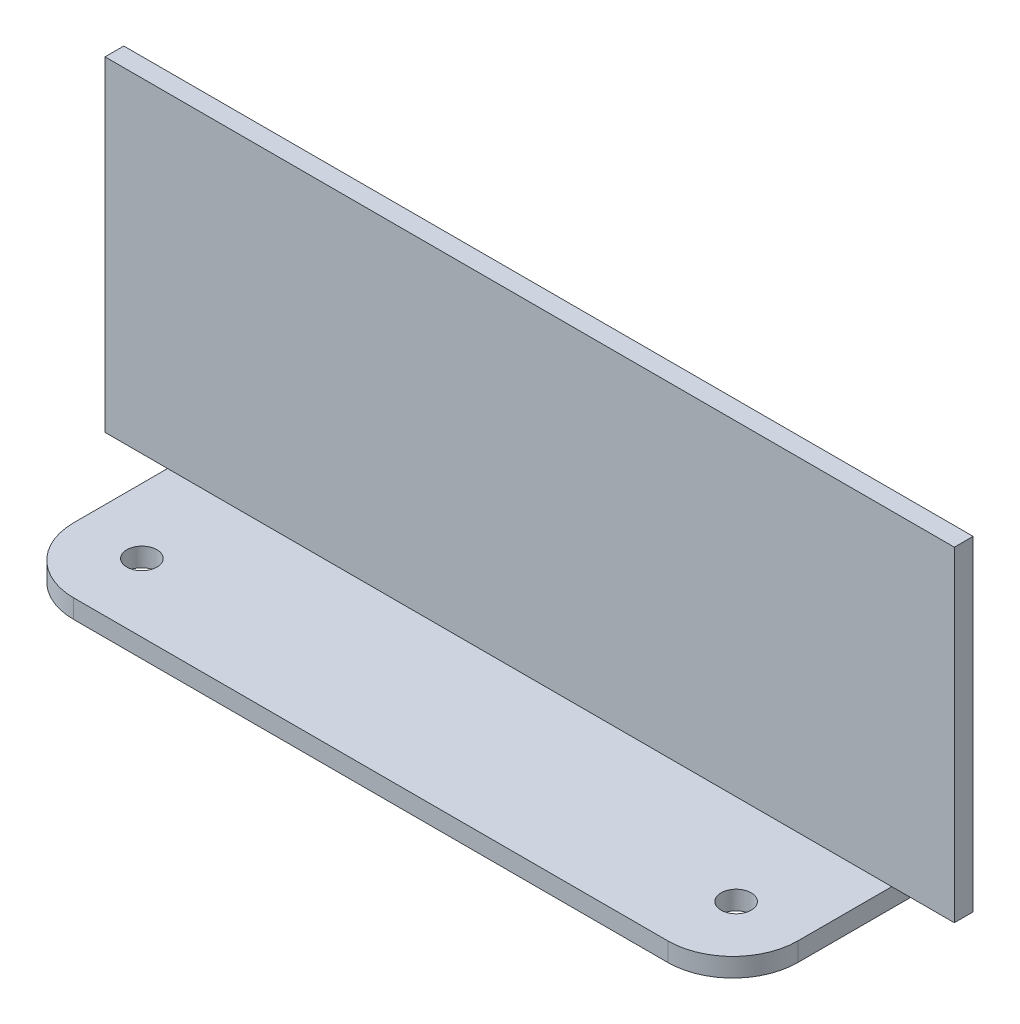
from build123d import *

# Parameters (mm, degrees)
SKETCH1_R           = 2.41
SKETCH1_W           = 115.78
SKETCH1_H           = 3
BOSS_EXTRUDE1_DEPTH = 3
SKETCH1_4_W         = 115.78
SKETCH1_4_H         = 3
BOSS_EXTRUDE2_DEPTH = 55
SKETCH3_W           = 3
SKETCH3_H           = 52
BOSS_EXTRUDE3_DEPTH = 10
SKETCH2_W           = 3
SKETCH2_H           = 52
BOSS_EXTRUDE4_DEPTH = 10


with BuildPart() as part:
    # Sketch1 → Boss-Extrude1 (new body)
    # profile 1 of 2: a face of its own
    with BuildSketch(Plane(origin=(0, 0, 0), x_dir=(1, 0, 0), z_dir=(0, 1, 0))):
        with BuildLine():
            ThreePointArc((0, 10.39), (3.043160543, 3.043160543), (10.39, 0))
            Line((10.39, 0), (105.39, 0))
            ThreePointArc((105.39, 0), (112.736839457, 3.043160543), (115.78, 10.39))
            Line((115.78, 10.39), (115.78, 10.91))
            Line((115.78, 10.91), (115.78, 11.43))
            Line((115.78, 11.43), (115.78, 25.41))
            Line((115.78, 25.41), (0, 25.41))
            Line((0, 25.41), (0, 11.43))
            Line((0, 11.43), (0, 10.91))
            Line((0, 10.91), (0, 10.39))
        make_face()
        with Locations(Location((10.39, 10.91, 0), (0, 0, 270))):
            Circle(SKETCH1_R, mode=Mode.SUBTRACT)
        with Locations(Location((105.39, 10.91, 0), (0, 0, 270))):
            Circle(SKETCH1_R, mode=Mode.SUBTRACT)
    # profile 2 of 2: a face of its own
    with BuildSketch(Plane(origin=(0, 0, 0), x_dir=(1, 0, 0), z_dir=(0, 1, 0))):
        with Locations((57.89, 26.91)):
            Rectangle(SKETCH1_W, SKETCH1_H)
    extrude(amount=BOSS_EXTRUDE1_DEPTH)

    # Sketch1_4 → Boss-Extrude2 (add)
    with BuildSketch(Plane(origin=(0, 0, 0), x_dir=(1, 0, 0), z_dir=(0, 1, 0))):
        with Locations((57.89, 26.91)):
            Rectangle(SKETCH1_4_W, SKETCH1_4_H)
    extrude(amount=BOSS_EXTRUDE2_DEPTH)

    # Sketch3 → Boss-Extrude3 (add)
    with BuildSketch(Plane.ZY):
        with Locations((-26.91, 29)):
            Rectangle(SKETCH3_W, SKETCH3_H)
    extrude(amount=BOSS_EXTRUDE3_DEPTH)

    # Sketch2 → Boss-Extrude4 (add)
    with BuildSketch(Plane(origin=(115.78, 0, 0), x_dir=(0, 0, -1), z_dir=(1, 0, 0))):
        with Locations((26.91, 29)):
            Rectangle(SKETCH2_W, SKETCH2_H)
    extrude(amount=BOSS_EXTRUDE4_DEPTH)


solid = part.part
